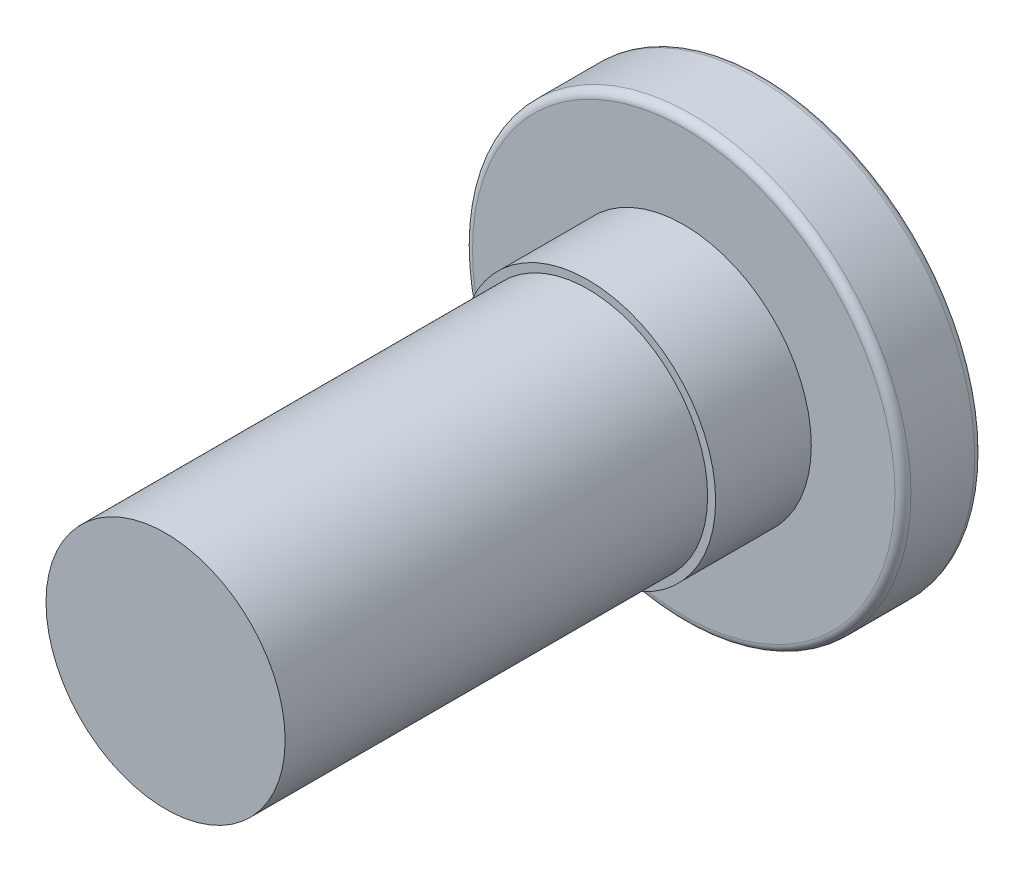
ISO-10303-21;
HEADER;
FILE_DESCRIPTION(('STEP AP214'),'2;1');
FILE_NAME('part.step','',(''),(''),'','','');
FILE_SCHEMA(('AUTOMOTIVE_DESIGN { 1 0 10303 214 1 1 1 1 }'));
ENDSEC;
DATA;
#1=APPLICATION_CONTEXT('core data for automotive mechanical design processes');
#2=APPLICATION_PROTOCOL_DEFINITION('international standard','automotive_design',2000,#1);
#3=PRODUCT_CONTEXT('',#1,'mechanical');
#4=PRODUCT('Part','Part','',(#3));
#5=PRODUCT_RELATED_PRODUCT_CATEGORY('part','',(#4));
#6=PRODUCT_DEFINITION_FORMATION('','',#4);
#7=PRODUCT_DEFINITION_CONTEXT('part definition',#1,'design');
#8=PRODUCT_DEFINITION('design','',#6,#7);
#9=PRODUCT_DEFINITION_SHAPE('','',#8);
#10=(LENGTH_UNIT() NAMED_UNIT(*) SI_UNIT(.MILLI.,.METRE.));
#11=(NAMED_UNIT(*) PLANE_ANGLE_UNIT() SI_UNIT($,.RADIAN.));
#12=(NAMED_UNIT(*) SI_UNIT($,.STERADIAN.) SOLID_ANGLE_UNIT());
#13=UNCERTAINTY_MEASURE_WITH_UNIT(LENGTH_MEASURE(1.E-05),#10,'distance_accuracy_value','');
#14=(GEOMETRIC_REPRESENTATION_CONTEXT(3) GLOBAL_UNCERTAINTY_ASSIGNED_CONTEXT((#13)) GLOBAL_UNIT_ASSIGNED_CONTEXT((#10,
#11,#12)) REPRESENTATION_CONTEXT('',''));
#15=CARTESIAN_POINT('',(0.,0.,0.));
#16=DIRECTION('',(0.,0.,1.));
#17=DIRECTION('',(1.,0.,0.));
#18=AXIS2_PLACEMENT_3D('',#15,#16,#17);
#19=CARTESIAN_POINT('',(0.,0.,1.));
#20=DIRECTION('',(0.,0.,1.));
#21=DIRECTION('',(1.,0.,0.));
#22=AXIS2_PLACEMENT_3D('',#19,#20,#21);
#23=PLANE('',#22);
#24=DIRECTION('',(0.,-1.,0.));
#25=VECTOR('',#24,1.);
#26=CARTESIAN_POINT('',(0.999999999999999,-0.577350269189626,1.));
#27=LINE('',#26,#25);
#28=CARTESIAN_POINT('',(0.999999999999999,-0.577350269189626,1.));
#29=VERTEX_POINT('',#28);
#30=CARTESIAN_POINT('',(0.999999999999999,0.577350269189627,1.));
#31=VERTEX_POINT('',#30);
#32=EDGE_CURVE('E84',#29,#31,#27,.F.);
#33=ORIENTED_EDGE('',*,*,#32,.F.);
#34=DIRECTION('',(-0.866025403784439,-0.5,0.));
#35=VECTOR('',#34,1.);
#36=CARTESIAN_POINT('',(0.,-1.15470053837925,1.));
#37=LINE('',#36,#35);
#38=CARTESIAN_POINT('',(0.,-1.15470053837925,1.));
#39=VERTEX_POINT('',#38);
#40=EDGE_CURVE('E81',#39,#29,#37,.F.);
#41=ORIENTED_EDGE('',*,*,#40,.F.);
#42=DIRECTION('',(-0.866025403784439,0.5,0.));
#43=VECTOR('',#42,1.);
#44=CARTESIAN_POINT('',(-1.,-0.577350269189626,1.));
#45=LINE('',#44,#43);
#46=CARTESIAN_POINT('',(-1.,-0.577350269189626,1.));
#47=VERTEX_POINT('',#46);
#48=EDGE_CURVE('E98',#47,#39,#45,.F.);
#49=ORIENTED_EDGE('',*,*,#48,.F.);
#50=DIRECTION('',(0.,1.,0.));
#51=VECTOR('',#50,1.);
#52=CARTESIAN_POINT('',(-1.,0.577350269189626,1.));
#53=LINE('',#52,#51);
#54=CARTESIAN_POINT('',(-1.,0.577350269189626,1.));
#55=VERTEX_POINT('',#54);
#56=EDGE_CURVE('E194',#55,#47,#53,.F.);
#57=ORIENTED_EDGE('',*,*,#56,.F.);
#58=DIRECTION('',(0.866025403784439,0.5,0.));
#59=VECTOR('',#58,1.);
#60=CARTESIAN_POINT('',(0.,1.15470053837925,1.));
#61=LINE('',#60,#59);
#62=CARTESIAN_POINT('',(0.,1.15470053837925,1.));
#63=VERTEX_POINT('',#62);
#64=EDGE_CURVE('E188',#63,#55,#61,.F.);
#65=ORIENTED_EDGE('',*,*,#64,.F.);
#66=DIRECTION('',(0.866025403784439,-0.5,0.));
#67=VECTOR('',#66,1.);
#68=CARTESIAN_POINT('',(0.999999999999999,0.577350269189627,1.));
#69=LINE('',#68,#67);
#70=EDGE_CURVE('E87',#31,#63,#69,.F.);
#71=ORIENTED_EDGE('',*,*,#70,.F.);
#72=EDGE_LOOP('',(#33,#41,#49,#57,#65,#71));
#73=FACE_BOUND('',#72,.T.);
#74=ADVANCED_FACE('F17',(#73),#23,.F.);
#75=CARTESIAN_POINT('',(0.999999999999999,-0.577350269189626,1.));
#76=DIRECTION('',(-1.,0.,0.));
#77=DIRECTION('',(0.,-1.,0.));
#78=AXIS2_PLACEMENT_3D('',#75,#76,#77);
#79=PLANE('',#78);
#80=ORIENTED_EDGE('',*,*,#32,.T.);
#81=DIRECTION('',(0.,0.,1.));
#82=VECTOR('',#81,1.);
#83=CARTESIAN_POINT('',(0.999999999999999,0.577350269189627,1.));
#84=LINE('',#83,#82);
#85=CARTESIAN_POINT('',(0.999999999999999,0.577350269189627,0.));
#86=VERTEX_POINT('',#85);
#87=EDGE_CURVE('E183',#86,#31,#84,.T.);
#88=ORIENTED_EDGE('',*,*,#87,.F.);
#89=DIRECTION('',(0.,1.,0.));
#90=VECTOR('',#89,1.);
#91=CARTESIAN_POINT('',(0.999999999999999,0.,0.));
#92=LINE('',#91,#90);
#93=CARTESIAN_POINT('',(0.999999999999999,-0.577350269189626,0.));
#94=VERTEX_POINT('',#93);
#95=EDGE_CURVE('E95',#86,#94,#92,.F.);
#96=ORIENTED_EDGE('',*,*,#95,.T.);
#97=DIRECTION('',(0.,0.,1.));
#98=VECTOR('',#97,1.);
#99=CARTESIAN_POINT('',(0.999999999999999,-0.577350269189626,1.));
#100=LINE('',#99,#98);
#101=EDGE_CURVE('E92',#29,#94,#100,.F.);
#102=ORIENTED_EDGE('',*,*,#101,.F.);
#103=EDGE_LOOP('',(#80,#88,#96,#102));
#104=FACE_BOUND('',#103,.T.);
#105=ADVANCED_FACE('F93',(#104),#79,.T.);
#106=CARTESIAN_POINT('',(0.,-1.15470053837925,1.));
#107=DIRECTION('',(-0.5,0.866025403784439,0.));
#108=DIRECTION('',(-0.866025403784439,-0.5,0.));
#109=AXIS2_PLACEMENT_3D('',#106,#107,#108);
#110=PLANE('',#109);
#111=ORIENTED_EDGE('',*,*,#40,.T.);
#112=ORIENTED_EDGE('',*,*,#101,.T.);
#113=DIRECTION('',(-0.866025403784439,-0.5,0.));
#114=VECTOR('',#113,1.);
#115=CARTESIAN_POINT('',(0.999999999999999,-0.577350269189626,0.));
#116=LINE('',#115,#114);
#117=CARTESIAN_POINT('',(0.,-1.15470053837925,0.));
#118=VERTEX_POINT('',#117);
#119=EDGE_CURVE('E220',#94,#118,#116,.T.);
#120=ORIENTED_EDGE('',*,*,#119,.T.);
#121=DIRECTION('',(0.,0.,1.));
#122=VECTOR('',#121,1.);
#123=CARTESIAN_POINT('',(0.,-1.15470053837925,1.));
#124=LINE('',#123,#122);
#125=EDGE_CURVE('E102',#39,#118,#124,.F.);
#126=ORIENTED_EDGE('',*,*,#125,.F.);
#127=EDGE_LOOP('',(#111,#112,#120,#126));
#128=FACE_BOUND('',#127,.T.);
#129=ADVANCED_FACE('F100',(#128),#110,.T.);
#130=CARTESIAN_POINT('',(-1.,-0.577350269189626,1.));
#131=DIRECTION('',(0.5,0.866025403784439,0.));
#132=DIRECTION('',(-0.866025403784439,0.5,0.));
#133=AXIS2_PLACEMENT_3D('',#130,#131,#132);
#134=PLANE('',#133);
#135=ORIENTED_EDGE('',*,*,#48,.T.);
#136=ORIENTED_EDGE('',*,*,#125,.T.);
#137=DIRECTION('',(-0.866025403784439,0.5,0.));
#138=VECTOR('',#137,1.);
#139=CARTESIAN_POINT('',(0.,-1.15470053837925,0.));
#140=LINE('',#139,#138);
#141=CARTESIAN_POINT('',(-1.,-0.577350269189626,0.));
#142=VERTEX_POINT('',#141);
#143=EDGE_CURVE('E221',#118,#142,#140,.T.);
#144=ORIENTED_EDGE('',*,*,#143,.T.);
#145=DIRECTION('',(0.,0.,1.));
#146=VECTOR('',#145,1.);
#147=CARTESIAN_POINT('',(-1.,-0.577350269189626,1.));
#148=LINE('',#147,#146);
#149=EDGE_CURVE('E191',#47,#142,#148,.F.);
#150=ORIENTED_EDGE('',*,*,#149,.F.);
#151=EDGE_LOOP('',(#135,#136,#144,#150));
#152=FACE_BOUND('',#151,.T.);
#153=ADVANCED_FACE('F199',(#152),#134,.T.);
#154=CARTESIAN_POINT('',(-1.,0.577350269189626,1.));
#155=DIRECTION('',(1.,0.,0.));
#156=DIRECTION('',(0.,1.,0.));
#157=AXIS2_PLACEMENT_3D('',#154,#155,#156);
#158=PLANE('',#157);
#159=ORIENTED_EDGE('',*,*,#56,.T.);
#160=ORIENTED_EDGE('',*,*,#149,.T.);
#161=DIRECTION('',(0.,1.,0.));
#162=VECTOR('',#161,1.);
#163=CARTESIAN_POINT('',(-1.,0.,0.));
#164=LINE('',#163,#162);
#165=CARTESIAN_POINT('',(-1.,0.577350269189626,0.));
#166=VERTEX_POINT('',#165);
#167=EDGE_CURVE('E206',#142,#166,#164,.T.);
#168=ORIENTED_EDGE('',*,*,#167,.T.);
#169=DIRECTION('',(0.,0.,1.));
#170=VECTOR('',#169,1.);
#171=CARTESIAN_POINT('',(-1.,0.577350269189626,1.));
#172=LINE('',#171,#170);
#173=EDGE_CURVE('E185',#55,#166,#172,.F.);
#174=ORIENTED_EDGE('',*,*,#173,.F.);
#175=EDGE_LOOP('',(#159,#160,#168,#174));
#176=FACE_BOUND('',#175,.T.);
#177=ADVANCED_FACE('F204',(#176),#158,.T.);
#178=CARTESIAN_POINT('',(0.,1.15470053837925,1.));
#179=DIRECTION('',(0.5,-0.866025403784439,0.));
#180=DIRECTION('',(0.866025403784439,0.5,0.));
#181=AXIS2_PLACEMENT_3D('',#178,#179,#180);
#182=PLANE('',#181);
#183=ORIENTED_EDGE('',*,*,#64,.T.);
#184=ORIENTED_EDGE('',*,*,#173,.T.);
#185=DIRECTION('',(0.866025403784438,0.5,0.));
#186=VECTOR('',#185,1.);
#187=CARTESIAN_POINT('',(-1.,0.577350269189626,0.));
#188=LINE('',#187,#186);
#189=CARTESIAN_POINT('',(0.,1.15470053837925,0.));
#190=VERTEX_POINT('',#189);
#191=EDGE_CURVE('E210',#166,#190,#188,.T.);
#192=ORIENTED_EDGE('',*,*,#191,.T.);
#193=DIRECTION('',(0.,0.,1.));
#194=VECTOR('',#193,1.);
#195=CARTESIAN_POINT('',(0.,1.15470053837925,1.));
#196=LINE('',#195,#194);
#197=EDGE_CURVE('E174',#63,#190,#196,.F.);
#198=ORIENTED_EDGE('',*,*,#197,.F.);
#199=EDGE_LOOP('',(#183,#184,#192,#198));
#200=FACE_BOUND('',#199,.T.);
#201=ADVANCED_FACE('F209',(#200),#182,.T.);
#202=CARTESIAN_POINT('',(0.999999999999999,0.577350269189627,1.));
#203=DIRECTION('',(-0.5,-0.866025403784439,0.));
#204=DIRECTION('',(0.866025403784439,-0.5,0.));
#205=AXIS2_PLACEMENT_3D('',#202,#203,#204);
#206=PLANE('',#205);
#207=ORIENTED_EDGE('',*,*,#70,.T.);
#208=ORIENTED_EDGE('',*,*,#197,.T.);
#209=DIRECTION('',(0.866025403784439,-0.5,0.));
#210=VECTOR('',#209,1.);
#211=CARTESIAN_POINT('',(0.,1.15470053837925,0.));
#212=LINE('',#211,#210);
#213=EDGE_CURVE('E215',#190,#86,#212,.T.);
#214=ORIENTED_EDGE('',*,*,#213,.T.);
#215=ORIENTED_EDGE('',*,*,#87,.T.);
#216=EDGE_LOOP('',(#207,#208,#214,#215));
#217=FACE_BOUND('',#216,.T.);
#218=ADVANCED_FACE('F214',(#217),#206,.T.);
#219=CARTESIAN_POINT('',(0.,0.,0.));
#220=DIRECTION('',(0.,0.,1.));
#221=DIRECTION('',(1.,0.,0.));
#222=AXIS2_PLACEMENT_3D('',#219,#220,#221);
#223=PLANE('',#222);
#224=ORIENTED_EDGE('',*,*,#191,.F.);
#225=ORIENTED_EDGE('',*,*,#167,.F.);
#226=ORIENTED_EDGE('',*,*,#143,.F.);
#227=ORIENTED_EDGE('',*,*,#119,.F.);
#228=ORIENTED_EDGE('',*,*,#95,.F.);
#229=ORIENTED_EDGE('',*,*,#213,.F.);
#230=EDGE_LOOP('',(#224,#225,#226,#227,#228,#229));
#231=FACE_BOUND('',#230,.T.);
#232=CARTESIAN_POINT('',(0.,0.,0.));
#233=DIRECTION('',(0.,0.,1.));
#234=DIRECTION('',(1.,0.,0.));
#235=AXIS2_PLACEMENT_3D('',#232,#233,#234);
#236=CIRCLE('',#235,2.65);
#237=CARTESIAN_POINT('',(2.65,0.,0.));
#238=VERTEX_POINT('',#237);
#239=CARTESIAN_POINT('',(-2.65,0.,0.));
#240=VERTEX_POINT('',#239);
#241=EDGE_CURVE('E217',#238,#240,#236,.T.);
#242=ORIENTED_EDGE('',*,*,#241,.F.);
#243=CARTESIAN_POINT('',(0.,0.,0.));
#244=DIRECTION('',(0.,0.,1.));
#245=DIRECTION('',(-1.,0.,0.));
#246=AXIS2_PLACEMENT_3D('',#243,#244,#245);
#247=CIRCLE('',#246,2.65);
#248=EDGE_CURVE('E237',#240,#238,#247,.T.);
#249=ORIENTED_EDGE('',*,*,#248,.F.);
#250=EDGE_LOOP('',(#242,#249));
#251=FACE_BOUND('',#250,.T.);
#252=ADVANCED_FACE('F162',(#231,#251),#223,.F.);
#253=CARTESIAN_POINT('',(0.,0.,0.1));
#254=DIRECTION('',(0.,0.,1.));
#255=DIRECTION('',(1.,0.,0.));
#256=AXIS2_PLACEMENT_3D('',#253,#254,#255);
#257=TOROIDAL_SURFACE('',#256,2.65,0.1);
#258=ORIENTED_EDGE('',*,*,#241,.T.);
#259=ORIENTED_EDGE('',*,*,#248,.T.);
#260=EDGE_LOOP('',(#258,#259));
#261=FACE_BOUND('',#260,.T.);
#262=CARTESIAN_POINT('',(0.,0.,0.1));
#263=DIRECTION('',(0.,0.,-1.));
#264=DIRECTION('',(-1.,0.,0.));
#265=AXIS2_PLACEMENT_3D('',#262,#263,#264);
#266=CIRCLE('',#265,2.75);
#267=CARTESIAN_POINT('',(-2.75,0.,0.1));
#268=VERTEX_POINT('',#267);
#269=EDGE_CURVE('E154',#268,#268,#266,.F.);
#270=ORIENTED_EDGE('',*,*,#269,.F.);
#271=EDGE_LOOP('',(#270));
#272=FACE_BOUND('',#271,.T.);
#273=ADVANCED_FACE('F158',(#261,#272),#257,.T.);
#274=CARTESIAN_POINT('',(0.,0.,1.));
#275=DIRECTION('',(0.,0.,-1.));
#276=DIRECTION('',(-1.,0.,0.));
#277=AXIS2_PLACEMENT_3D('',#274,#275,#276);
#278=CYLINDRICAL_SURFACE('',#277,2.75);
#279=CARTESIAN_POINT('',(0.,0.,0.9));
#280=DIRECTION('',(0.,0.,1.));
#281=DIRECTION('',(1.,0.,0.));
#282=AXIS2_PLACEMENT_3D('',#279,#280,#281);
#283=CIRCLE('',#282,2.75);
#284=CARTESIAN_POINT('',(2.75,0.,0.9));
#285=VERTEX_POINT('',#284);
#286=EDGE_CURVE('E146',#285,#285,#283,.T.);
#287=ORIENTED_EDGE('',*,*,#286,.F.);
#288=EDGE_LOOP('',(#287));
#289=FACE_BOUND('',#288,.T.);
#290=ORIENTED_EDGE('',*,*,#269,.T.);
#291=EDGE_LOOP('',(#290));
#292=FACE_BOUND('',#291,.T.);
#293=ADVANCED_FACE('F132',(#289,#292),#278,.T.);
#294=CARTESIAN_POINT('',(0.,0.,0.9));
#295=DIRECTION('',(0.,0.,1.));
#296=DIRECTION('',(1.,0.,0.));
#297=AXIS2_PLACEMENT_3D('',#294,#295,#296);
#298=TOROIDAL_SURFACE('',#297,2.65,0.1);
#299=ORIENTED_EDGE('',*,*,#286,.T.);
#300=EDGE_LOOP('',(#299));
#301=FACE_BOUND('',#300,.T.);
#302=CARTESIAN_POINT('',(0.,0.,1.));
#303=DIRECTION('',(0.,0.,-1.));
#304=DIRECTION('',(1.,0.,0.));
#305=AXIS2_PLACEMENT_3D('',#302,#303,#304);
#306=CIRCLE('',#305,2.65);
#307=CARTESIAN_POINT('',(-2.65,0.,1.));
#308=VERTEX_POINT('',#307);
#309=CARTESIAN_POINT('',(2.65,0.,1.));
#310=VERTEX_POINT('',#309);
#311=EDGE_CURVE('E36',#308,#310,#306,.F.);
#312=ORIENTED_EDGE('',*,*,#311,.F.);
#313=CARTESIAN_POINT('',(0.,0.,1.));
#314=DIRECTION('',(0.,0.,-1.));
#315=DIRECTION('',(-1.,0.,0.));
#316=AXIS2_PLACEMENT_3D('',#313,#314,#315);
#317=CIRCLE('',#316,2.65);
#318=EDGE_CURVE('E116',#310,#308,#317,.F.);
#319=ORIENTED_EDGE('',*,*,#318,.F.);
#320=EDGE_LOOP('',(#312,#319));
#321=FACE_BOUND('',#320,.T.);
#322=ADVANCED_FACE('F120',(#301,#321),#298,.T.);
#323=CARTESIAN_POINT('',(0.,0.,1.));
#324=DIRECTION('',(0.,0.,1.));
#325=DIRECTION('',(1.,0.,0.));
#326=AXIS2_PLACEMENT_3D('',#323,#324,#325);
#327=PLANE('',#326);
#328=CARTESIAN_POINT('',(0.,0.,1.));
#329=DIRECTION('',(0.,0.,-1.));
#330=DIRECTION('',(-1.,0.,0.));
#331=AXIS2_PLACEMENT_3D('',#328,#329,#330);
#332=CIRCLE('',#331,1.6);
#333=CARTESIAN_POINT('',(-1.6,0.,1.));
#334=VERTEX_POINT('',#333);
#335=EDGE_CURVE('E112',#334,#334,#332,.F.);
#336=ORIENTED_EDGE('',*,*,#335,.F.);
#337=EDGE_LOOP('',(#336));
#338=FACE_BOUND('',#337,.T.);
#339=ORIENTED_EDGE('',*,*,#318,.T.);
#340=ORIENTED_EDGE('',*,*,#311,.T.);
#341=EDGE_LOOP('',(#339,#340));
#342=FACE_BOUND('',#341,.T.);
#343=ADVANCED_FACE('F131',(#338,#342),#327,.T.);
#344=CARTESIAN_POINT('',(0.,0.,2.2));
#345=DIRECTION('',(0.,0.,-1.));
#346=DIRECTION('',(-1.,0.,0.));
#347=AXIS2_PLACEMENT_3D('',#344,#345,#346);
#348=CYLINDRICAL_SURFACE('',#347,1.6);
#349=ORIENTED_EDGE('',*,*,#335,.T.);
#350=EDGE_LOOP('',(#349));
#351=FACE_BOUND('',#350,.T.);
#352=CARTESIAN_POINT('',(0.,0.,2.2));
#353=DIRECTION('',(0.,0.,-1.));
#354=DIRECTION('',(-1.,0.,0.));
#355=AXIS2_PLACEMENT_3D('',#352,#353,#354);
#356=CIRCLE('',#355,1.6);
#357=CARTESIAN_POINT('',(-1.6,0.,2.2));
#358=VERTEX_POINT('',#357);
#359=EDGE_CURVE('E109',#358,#358,#356,.F.);
#360=ORIENTED_EDGE('',*,*,#359,.F.);
#361=EDGE_LOOP('',(#360));
#362=FACE_BOUND('',#361,.T.);
#363=ADVANCED_FACE('F269',(#351,#362),#348,.T.);
#364=CARTESIAN_POINT('',(0.,0.,7.5));
#365=DIRECTION('',(0.,0.,1.));
#366=DIRECTION('',(1.,0.,0.));
#367=AXIS2_PLACEMENT_3D('',#364,#365,#366);
#368=PLANE('',#367);
#369=CARTESIAN_POINT('',(0.,0.,7.5));
#370=DIRECTION('',(0.,0.,-1.));
#371=DIRECTION('',(-1.,0.,0.));
#372=AXIS2_PLACEMENT_3D('',#369,#370,#371);
#373=CIRCLE('',#372,1.5);
#374=CARTESIAN_POINT('',(-1.5,0.,7.5));
#375=VERTEX_POINT('',#374);
#376=EDGE_CURVE('E28',#375,#375,#373,.T.);
#377=ORIENTED_EDGE('',*,*,#376,.F.);
#378=EDGE_LOOP('',(#377));
#379=FACE_BOUND('',#378,.T.);
#380=ADVANCED_FACE('F263',(#379),#368,.T.);
#381=CARTESIAN_POINT('',(0.,0.,2.2));
#382=DIRECTION('',(0.,0.,1.));
#383=DIRECTION('',(1.,0.,0.));
#384=AXIS2_PLACEMENT_3D('',#381,#382,#383);
#385=PLANE('',#384);
#386=CARTESIAN_POINT('',(0.,0.,2.2));
#387=DIRECTION('',(0.,0.,-1.));
#388=DIRECTION('',(-1.,0.,0.));
#389=AXIS2_PLACEMENT_3D('',#386,#387,#388);
#390=CIRCLE('',#389,1.5);
#391=CARTESIAN_POINT('',(-1.5,0.,2.2));
#392=VERTEX_POINT('',#391);
#393=EDGE_CURVE('E11',#392,#392,#390,.F.);
#394=ORIENTED_EDGE('',*,*,#393,.F.);
#395=EDGE_LOOP('',(#394));
#396=FACE_BOUND('',#395,.T.);
#397=ORIENTED_EDGE('',*,*,#359,.T.);
#398=EDGE_LOOP('',(#397));
#399=FACE_BOUND('',#398,.T.);
#400=ADVANCED_FACE('F257',(#396,#399),#385,.T.);
#401=CARTESIAN_POINT('',(0.,0.,7.5));
#402=DIRECTION('',(0.,0.,-1.));
#403=DIRECTION('',(-1.,0.,0.));
#404=AXIS2_PLACEMENT_3D('',#401,#402,#403);
#405=CYLINDRICAL_SURFACE('',#404,1.5);
#406=ORIENTED_EDGE('',*,*,#393,.T.);
#407=EDGE_LOOP('',(#406));
#408=FACE_BOUND('',#407,.T.);
#409=ORIENTED_EDGE('',*,*,#376,.T.);
#410=EDGE_LOOP('',(#409));
#411=FACE_BOUND('',#410,.T.);
#412=ADVANCED_FACE('F255',(#408,#411),#405,.T.);
#413=CLOSED_SHELL('',(#74,#105,#129,#153,#177,#201,#218,#252,#273,#293,#322,#343,#363,#380,#400,#412));
#414=MANIFOLD_SOLID_BREP('B1',#413);
#415=ADVANCED_BREP_SHAPE_REPRESENTATION('',(#18,#414),#14);
#416=SHAPE_DEFINITION_REPRESENTATION(#9,#415);
ENDSEC;
END-ISO-10303-21;
